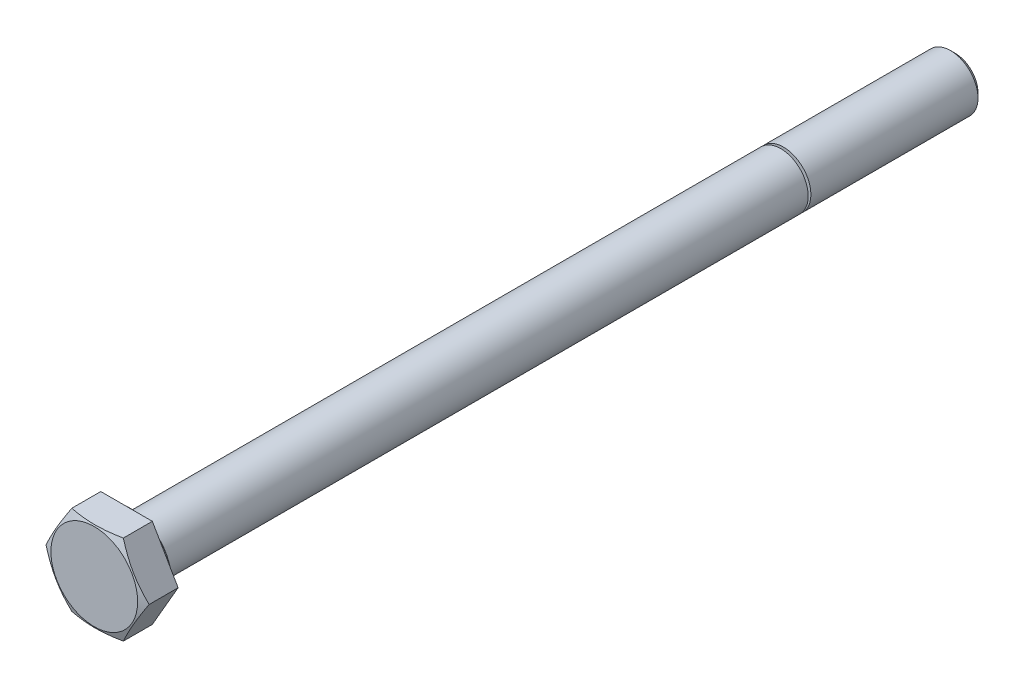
ISO-10303-21;
HEADER;
FILE_DESCRIPTION(('STEP AP214'),'2;1');
FILE_NAME('part.step','',(''),(''),'','','');
FILE_SCHEMA(('AUTOMOTIVE_DESIGN { 1 0 10303 214 1 1 1 1 }'));
ENDSEC;
DATA;
#1=APPLICATION_CONTEXT('core data for automotive mechanical design processes');
#2=APPLICATION_PROTOCOL_DEFINITION('international standard','automotive_design',2000,#1);
#3=PRODUCT_CONTEXT('',#1,'mechanical');
#4=PRODUCT('Part','Part','',(#3));
#5=PRODUCT_RELATED_PRODUCT_CATEGORY('part','',(#4));
#6=PRODUCT_DEFINITION_FORMATION('','',#4);
#7=PRODUCT_DEFINITION_CONTEXT('part definition',#1,'design');
#8=PRODUCT_DEFINITION('design','',#6,#7);
#9=PRODUCT_DEFINITION_SHAPE('','',#8);
#10=(LENGTH_UNIT() NAMED_UNIT(*) SI_UNIT(.MILLI.,.METRE.));
#11=(NAMED_UNIT(*) PLANE_ANGLE_UNIT() SI_UNIT($,.RADIAN.));
#12=(NAMED_UNIT(*) SI_UNIT($,.STERADIAN.) SOLID_ANGLE_UNIT());
#13=UNCERTAINTY_MEASURE_WITH_UNIT(LENGTH_MEASURE(1.E-05),#10,'distance_accuracy_value','');
#14=(GEOMETRIC_REPRESENTATION_CONTEXT(3) GLOBAL_UNCERTAINTY_ASSIGNED_CONTEXT((#13)) GLOBAL_UNIT_ASSIGNED_CONTEXT((#10,
#11,#12)) REPRESENTATION_CONTEXT('',''));
#15=CARTESIAN_POINT('',(0.,0.,0.));
#16=DIRECTION('',(0.,0.,1.));
#17=DIRECTION('',(1.,0.,0.));
#18=AXIS2_PLACEMENT_3D('',#15,#16,#17);
#19=CARTESIAN_POINT('',(0.,6.29999999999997,0.6));
#20=DIRECTION('',(0.,0.,1.));
#21=DIRECTION('',(1.,0.,0.));
#22=AXIS2_PLACEMENT_3D('',#19,#20,#21);
#23=PLANE('',#22);
#24=CARTESIAN_POINT('',(0.,0.,0.6));
#25=DIRECTION('',(0.,0.,1.));
#26=DIRECTION('',(1.,0.,0.));
#27=AXIS2_PLACEMENT_3D('',#24,#25,#26);
#28=CIRCLE('',#27,6.3);
#29=CARTESIAN_POINT('',(6.3,0.,0.599999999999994));
#30=VERTEX_POINT('',#29);
#31=EDGE_CURVE('E229',#30,#30,#28,.T.);
#32=ORIENTED_EDGE('',*,*,#31,.T.);
#33=EDGE_LOOP('',(#32));
#34=FACE_BOUND('',#33,.T.);
#35=DIRECTION('',(-1.,0.,0.));
#36=VECTOR('',#35,1.);
#37=CARTESIAN_POINT('',(0.,-6.4999969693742,0.6));
#38=LINE('',#37,#36);
#39=CARTESIAN_POINT('',(3.75277500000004,-6.49999696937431,0.6));
#40=VERTEX_POINT('',#39);
#41=CARTESIAN_POINT('',(-3.75277499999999,-6.49999696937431,0.6));
#42=VERTEX_POINT('',#41);
#43=EDGE_CURVE('E215',#40,#42,#38,.T.);
#44=ORIENTED_EDGE('',*,*,#43,.T.);
#45=DIRECTION('',(-0.500000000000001,0.866025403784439,0.));
#46=VECTOR('',#45,1.);
#47=CARTESIAN_POINT('',(-8.35714252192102,1.47500151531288,0.600000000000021));
#48=LINE('',#47,#46);
#49=CARTESIAN_POINT('',(-7.50555000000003,0.,0.600000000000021));
#50=VERTEX_POINT('',#49);
#51=EDGE_CURVE('E84',#42,#50,#48,.T.);
#52=ORIENTED_EDGE('',*,*,#51,.T.);
#53=DIRECTION('',(0.5,0.866025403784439,0.));
#54=VECTOR('',#53,1.);
#55=CARTESIAN_POINT('',(-2.901182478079,7.97499848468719,0.599999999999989));
#56=LINE('',#55,#54);
#57=CARTESIAN_POINT('',(-3.75277499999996,6.49999696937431,0.599999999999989));
#58=VERTEX_POINT('',#57);
#59=EDGE_CURVE('E223',#50,#58,#56,.T.);
#60=ORIENTED_EDGE('',*,*,#59,.T.);
#61=DIRECTION('',(1.,0.,0.));
#62=VECTOR('',#61,1.);
#63=CARTESIAN_POINT('',(0.,6.49999696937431,0.6));
#64=LINE('',#63,#62);
#65=CARTESIAN_POINT('',(3.75277499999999,6.49999696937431,0.6));
#66=VERTEX_POINT('',#65);
#67=EDGE_CURVE('E220',#58,#66,#64,.T.);
#68=ORIENTED_EDGE('',*,*,#67,.T.);
#69=DIRECTION('',(0.500000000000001,-0.866025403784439,0.));
#70=VECTOR('',#69,1.);
#71=CARTESIAN_POINT('',(2.90118247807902,7.97499848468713,0.6));
#72=LINE('',#71,#70);
#73=CARTESIAN_POINT('',(7.50555000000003,0.,0.599999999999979));
#74=VERTEX_POINT('',#73);
#75=EDGE_CURVE('E218',#66,#74,#72,.T.);
#76=ORIENTED_EDGE('',*,*,#75,.T.);
#77=DIRECTION('',(-0.5,-0.866025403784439,0.));
#78=VECTOR('',#77,1.);
#79=CARTESIAN_POINT('',(8.3571425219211,1.47500151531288,0.599999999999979));
#80=LINE('',#79,#78);
#81=EDGE_CURVE('E203',#74,#40,#80,.T.);
#82=ORIENTED_EDGE('',*,*,#81,.T.);
#83=EDGE_LOOP('',(#44,#52,#60,#68,#76,#82));
#84=FACE_BOUND('',#83,.T.);
#85=ADVANCED_FACE('F17',(#34,#84),#23,.F.);
#86=CARTESIAN_POINT('',(1.11022302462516E-13,0.,-120.));
#87=DIRECTION('',(0.,0.,1.));
#88=DIRECTION('',(1.,0.,0.));
#89=AXIS2_PLACEMENT_3D('',#86,#87,#88);
#90=PLANE('',#89);
#91=CARTESIAN_POINT('',(1.11022302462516E-13,0.,-120.));
#92=DIRECTION('',(0.,0.,1.));
#93=DIRECTION('',(1.,0.,0.));
#94=AXIS2_PLACEMENT_3D('',#91,#92,#93);
#95=CIRCLE('',#94,3.3234375);
#96=CARTESIAN_POINT('',(3.32343750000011,0.,-120.));
#97=VERTEX_POINT('',#96);
#98=EDGE_CURVE('E77',#97,#97,#95,.T.);
#99=ORIENTED_EDGE('',*,*,#98,.F.);
#100=EDGE_LOOP('',(#99));
#101=FACE_BOUND('',#100,.T.);
#102=ADVANCED_FACE('F19',(#101),#90,.F.);
#103=CARTESIAN_POINT('',(1.11022302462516E-13,0.,-120.));
#104=DIRECTION('',(0.,0.,1.));
#105=DIRECTION('',(1.,0.,0.));
#106=AXIS2_PLACEMENT_3D('',#103,#104,#105);
#107=CONICAL_SURFACE('',#106,3.3234375,0.785398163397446);
#108=CARTESIAN_POINT('',(1.11022302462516E-13,0.,-119.3234375));
#109=DIRECTION('',(0.,0.,1.));
#110=DIRECTION('',(1.,0.,0.));
#111=AXIS2_PLACEMENT_3D('',#108,#109,#110);
#112=CIRCLE('',#111,4.);
#113=CARTESIAN_POINT('',(4.00000000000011,0.,-119.3234375));
#114=VERTEX_POINT('',#113);
#115=EDGE_CURVE('E173',#114,#114,#112,.T.);
#116=ORIENTED_EDGE('',*,*,#115,.F.);
#117=EDGE_LOOP('',(#116));
#118=FACE_BOUND('',#117,.T.);
#119=ORIENTED_EDGE('',*,*,#98,.T.);
#120=EDGE_LOOP('',(#119));
#121=FACE_BOUND('',#120,.T.);
#122=ADVANCED_FACE('F135',(#118,#121),#107,.T.);
#123=CARTESIAN_POINT('',(0.,0.,5.3));
#124=DIRECTION('',(0.,0.,1.));
#125=DIRECTION('',(1.,0.,0.));
#126=AXIS2_PLACEMENT_3D('',#123,#124,#125);
#127=CYLINDRICAL_SURFACE('',#126,4.);
#128=CARTESIAN_POINT('',(1.11022302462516E-13,0.,-95.));
#129=DIRECTION('',(0.,0.,1.));
#130=DIRECTION('',(1.,0.,0.));
#131=AXIS2_PLACEMENT_3D('',#128,#129,#130);
#132=CIRCLE('',#131,4.);
#133=CARTESIAN_POINT('',(4.00000000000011,0.,-95.));
#134=VERTEX_POINT('',#133);
#135=EDGE_CURVE('E177',#134,#134,#132,.T.);
#136=ORIENTED_EDGE('',*,*,#135,.F.);
#137=EDGE_LOOP('',(#136));
#138=FACE_BOUND('',#137,.T.);
#139=ORIENTED_EDGE('',*,*,#115,.T.);
#140=EDGE_LOOP('',(#139));
#141=FACE_BOUND('',#140,.T.);
#142=ADVANCED_FACE('F162',(#138,#141),#127,.T.);
#143=CARTESIAN_POINT('',(0.,4.,-95.));
#144=DIRECTION('',(0.,0.,-1.));
#145=DIRECTION('',(-1.,0.,0.));
#146=AXIS2_PLACEMENT_3D('',#143,#144,#145);
#147=PLANE('',#146);
#148=CARTESIAN_POINT('',(1.11022302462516E-13,0.,-95.));
#149=DIRECTION('',(0.,0.,1.));
#150=DIRECTION('',(1.,0.,0.));
#151=AXIS2_PLACEMENT_3D('',#148,#149,#150);
#152=CIRCLE('',#151,3.3234375);
#153=CARTESIAN_POINT('',(3.32343750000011,0.,-95.));
#154=VERTEX_POINT('',#153);
#155=EDGE_CURVE('E243',#154,#154,#152,.T.);
#156=ORIENTED_EDGE('',*,*,#155,.F.);
#157=EDGE_LOOP('',(#156));
#158=FACE_BOUND('',#157,.T.);
#159=ORIENTED_EDGE('',*,*,#135,.T.);
#160=EDGE_LOOP('',(#159));
#161=FACE_BOUND('',#160,.T.);
#162=ADVANCED_FACE('F158',(#158,#161),#147,.F.);
#163=CARTESIAN_POINT('',(1.11022302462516E-13,0.,-95.));
#164=DIRECTION('',(0.,0.,1.));
#165=DIRECTION('',(1.,0.,0.));
#166=AXIS2_PLACEMENT_3D('',#163,#164,#165);
#167=CONICAL_SURFACE('',#166,3.3234375,1.0471975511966);
#168=CARTESIAN_POINT('',(1.11022302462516E-13,0.,-94.6093864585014));
#169=DIRECTION('',(0.,0.,1.));
#170=DIRECTION('',(1.,0.,0.));
#171=AXIS2_PLACEMENT_3D('',#168,#169,#170);
#172=CIRCLE('',#171,4.);
#173=CARTESIAN_POINT('',(4.00000000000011,0.,-94.6093864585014));
#174=VERTEX_POINT('',#173);
#175=EDGE_CURVE('E240',#174,#174,#172,.T.);
#176=ORIENTED_EDGE('',*,*,#175,.F.);
#177=EDGE_LOOP('',(#176));
#178=FACE_BOUND('',#177,.T.);
#179=ORIENTED_EDGE('',*,*,#155,.T.);
#180=EDGE_LOOP('',(#179));
#181=FACE_BOUND('',#180,.T.);
#182=ADVANCED_FACE('F154',(#178,#181),#167,.T.);
#183=CARTESIAN_POINT('',(0.,0.,5.3));
#184=DIRECTION('',(0.,0.,1.));
#185=DIRECTION('',(1.,0.,0.));
#186=AXIS2_PLACEMENT_3D('',#183,#184,#185);
#187=CYLINDRICAL_SURFACE('',#186,4.);
#188=CARTESIAN_POINT('',(0.,0.,-0.400000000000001));
#189=DIRECTION('',(0.,0.,1.));
#190=DIRECTION('',(1.,0.,0.));
#191=AXIS2_PLACEMENT_3D('',#188,#189,#190);
#192=CIRCLE('',#191,4.);
#193=CARTESIAN_POINT('',(4.,0.,-0.400000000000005));
#194=VERTEX_POINT('',#193);
#195=EDGE_CURVE('E237',#194,#194,#192,.T.);
#196=ORIENTED_EDGE('',*,*,#195,.F.);
#197=EDGE_LOOP('',(#196));
#198=FACE_BOUND('',#197,.T.);
#199=ORIENTED_EDGE('',*,*,#175,.T.);
#200=EDGE_LOOP('',(#199));
#201=FACE_BOUND('',#200,.T.);
#202=ADVANCED_FACE('F150',(#198,#201),#187,.T.);
#203=CARTESIAN_POINT('',(0.,0.,-0.400000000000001));
#204=DIRECTION('',(0.,0.,1.));
#205=DIRECTION('',(1.,0.,0.));
#206=AXIS2_PLACEMENT_3D('',#203,#204,#205);
#207=TOROIDAL_SURFACE('',#206,4.4,0.4);
#208=ORIENTED_EDGE('',*,*,#195,.T.);
#209=EDGE_LOOP('',(#208));
#210=FACE_BOUND('',#209,.T.);
#211=CARTESIAN_POINT('',(0.,0.,0.));
#212=DIRECTION('',(0.,0.,1.));
#213=DIRECTION('',(1.,0.,0.));
#214=AXIS2_PLACEMENT_3D('',#211,#212,#213);
#215=CIRCLE('',#214,4.4);
#216=CARTESIAN_POINT('',(4.4,0.,0.));
#217=VERTEX_POINT('',#216);
#218=EDGE_CURVE('E234',#217,#217,#215,.T.);
#219=ORIENTED_EDGE('',*,*,#218,.F.);
#220=EDGE_LOOP('',(#219));
#221=FACE_BOUND('',#220,.T.);
#222=ADVANCED_FACE('F146',(#210,#221),#207,.F.);
#223=CARTESIAN_POINT('',(0.,4.40000000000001,0.));
#224=DIRECTION('',(0.,0.,1.));
#225=DIRECTION('',(1.,0.,0.));
#226=AXIS2_PLACEMENT_3D('',#223,#224,#225);
#227=PLANE('',#226);
#228=CARTESIAN_POINT('',(0.,0.,0.));
#229=DIRECTION('',(0.,0.,1.));
#230=DIRECTION('',(1.,0.,0.));
#231=AXIS2_PLACEMENT_3D('',#228,#229,#230);
#232=CIRCLE('',#231,5.7);
#233=CARTESIAN_POINT('',(5.7,0.,0.));
#234=VERTEX_POINT('',#233);
#235=EDGE_CURVE('E231',#234,#234,#232,.T.);
#236=ORIENTED_EDGE('',*,*,#235,.F.);
#237=EDGE_LOOP('',(#236));
#238=FACE_BOUND('',#237,.T.);
#239=ORIENTED_EDGE('',*,*,#218,.T.);
#240=EDGE_LOOP('',(#239));
#241=FACE_BOUND('',#240,.T.);
#242=ADVANCED_FACE('F142',(#238,#241),#227,.F.);
#243=CARTESIAN_POINT('',(0.,0.,0.6));
#244=DIRECTION('',(0.,0.,1.));
#245=DIRECTION('',(1.,0.,0.));
#246=AXIS2_PLACEMENT_3D('',#243,#244,#245);
#247=TOROIDAL_SURFACE('',#246,5.7,0.6);
#248=ORIENTED_EDGE('',*,*,#31,.F.);
#249=EDGE_LOOP('',(#248));
#250=FACE_BOUND('',#249,.T.);
#251=ORIENTED_EDGE('',*,*,#235,.T.);
#252=EDGE_LOOP('',(#251));
#253=FACE_BOUND('',#252,.T.);
#254=ADVANCED_FACE('F117',(#250,#253),#247,.T.);
#255=CARTESIAN_POINT('',(-3.75277499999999,-6.49999696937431,-120.));
#256=DIRECTION('',(0.866025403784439,0.5,0.));
#257=DIRECTION('',(0.500000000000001,-0.866025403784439,0.));
#258=AXIS2_PLACEMENT_3D('',#255,#256,#257);
#259=PLANE('',#258);
#260=ORIENTED_EDGE('',*,*,#51,.F.);
#261=DIRECTION('',(0.,0.,1.));
#262=VECTOR('',#261,1.);
#263=CARTESIAN_POINT('',(-3.75277499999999,-6.49999696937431,-120.));
#264=LINE('',#263,#262);
#265=CARTESIAN_POINT('',(-3.75277499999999,-6.49999696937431,4.81818181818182));
#266=VERTEX_POINT('',#265);
#267=EDGE_CURVE('E37',#42,#266,#264,.T.);
#268=ORIENTED_EDGE('',*,*,#267,.T.);
#269=CARTESIAN_POINT('',(-7.50555011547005,2.00000016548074E-07,4.81818177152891));
#270=CARTESIAN_POINT('',(-7.37443828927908,-0.227092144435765,4.87115743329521));
#271=CARTESIAN_POINT('',(-7.24289371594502,-0.454934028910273,4.92014195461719));
#272=CARTESIAN_POINT('',(-6.97893474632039,-0.912124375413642,5.00862317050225));
#273=CARTESIAN_POINT('',(-6.84651988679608,-1.14147363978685,5.04811430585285));
#274=CARTESIAN_POINT('',(-6.58100882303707,-1.60135229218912,5.11602763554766));
#275=CARTESIAN_POINT('',(-6.44791283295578,-1.8318813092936,5.14445311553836));
#276=CARTESIAN_POINT('',(-6.18122645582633,-2.29379566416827,5.18891785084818));
#277=CARTESIAN_POINT('',(-6.04763618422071,-2.52518080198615,5.20495983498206));
#278=CARTESIAN_POINT('',(-5.78248936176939,-2.98442856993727,5.22365999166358));
#279=CARTESIAN_POINT('',(-5.65093679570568,-3.21228429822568,5.22654079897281));
#280=CARTESIAN_POINT('',(-5.387909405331,-3.66786110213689,5.21936907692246));
#281=CARTESIAN_POINT('',(-5.25643458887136,-3.89558216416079,5.20931541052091));
#282=CARTESIAN_POINT('',(-4.99395979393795,-4.35020184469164,5.17681520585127));
#283=CARTESIAN_POINT('',(-4.86295956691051,-4.57710089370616,5.15437654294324));
#284=CARTESIAN_POINT('',(-4.60158457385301,-5.02981566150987,5.09819377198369));
#285=CARTESIAN_POINT('',(-4.47120974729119,-5.25563148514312,5.06445078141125));
#286=CARTESIAN_POINT('',(-4.29203841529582,-5.56596533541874,5.01111287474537));
#287=CARTESIAN_POINT('',(-4.24291545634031,-5.65104879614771,4.99576396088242));
#288=CARTESIAN_POINT('',(-4.14478547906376,-5.82101490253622,4.9637295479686));
#289=CARTESIAN_POINT('',(-4.0957784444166,-5.9058975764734,4.94704425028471));
#290=CARTESIAN_POINT('',(-3.99770849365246,-6.07575971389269,4.91235486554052));
#291=CARTESIAN_POINT('',(-3.94864596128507,-6.16073851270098,4.89434645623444));
#292=CARTESIAN_POINT('',(-3.85062839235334,-6.33050992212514,4.85713794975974));
#293=CARTESIAN_POINT('',(-3.80167336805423,-6.41530251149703,4.83793772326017));
#294=CARTESIAN_POINT('',(-3.75277488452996,-6.49999716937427,4.81818177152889));
#295=B_SPLINE_CURVE_WITH_KNOTS('',3,(#269,#270,#271,#272,#273,#274,#275,#276,#277,#278,#279,
#280,#281,#282,#283,#284,#285,#286,#287,#288,#289,#290,#291,#292,#293,#294),.UNSPECIFIED.,.F.,
.F.,(4,2,2,2,2,2,2,2,2,2,2,2,4),(0.,0.802620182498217,1.60570923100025,2.40855964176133,
3.21123308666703,4.00027695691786,4.7893901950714,5.57800222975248,6.36653632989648,
6.66484369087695,6.96310618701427,7.26239050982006,7.56170736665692),.UNSPECIFIED.);
#296=CARTESIAN_POINT('',(-7.50554999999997,0.,4.81818181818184));
#297=VERTEX_POINT('',#296);
#298=EDGE_CURVE('E11',#297,#266,#295,.T.);
#299=ORIENTED_EDGE('',*,*,#298,.F.);
#300=DIRECTION('',(0.,0.,1.));
#301=VECTOR('',#300,1.);
#302=CARTESIAN_POINT('',(-7.50555,0.,-120.));
#303=LINE('',#302,#301);
#304=EDGE_CURVE('E213',#50,#297,#303,.T.);
#305=ORIENTED_EDGE('',*,*,#304,.F.);
#306=EDGE_LOOP('',(#260,#268,#299,#305));
#307=FACE_BOUND('',#306,.T.);
#308=ADVANCED_FACE('F80',(#307),#259,.F.);
#309=CARTESIAN_POINT('',(-7.50555,0.,-120.));
#310=DIRECTION('',(0.866025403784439,-0.5,0.));
#311=DIRECTION('',(-0.5,-0.866025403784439,0.));
#312=AXIS2_PLACEMENT_3D('',#309,#310,#311);
#313=PLANE('',#312);
#314=ORIENTED_EDGE('',*,*,#59,.F.);
#315=ORIENTED_EDGE('',*,*,#304,.T.);
#316=CARTESIAN_POINT('',(-3.75277488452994,6.49999716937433,4.81818177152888));
#317=CARTESIAN_POINT('',(-3.8838867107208,6.27290482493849,4.87115743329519));
#318=CARTESIAN_POINT('',(-4.01543128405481,6.04506294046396,4.92014195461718));
#319=CARTESIAN_POINT('',(-4.27939025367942,5.58787259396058,5.00862317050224));
#320=CARTESIAN_POINT('',(-4.41180511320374,5.35852332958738,5.04811430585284));
#321=CARTESIAN_POINT('',(-4.67731617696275,4.89864467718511,5.11602763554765));
#322=CARTESIAN_POINT('',(-4.81041216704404,4.66811566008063,5.14445311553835));
#323=CARTESIAN_POINT('',(-5.07709854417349,4.20620130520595,5.18891785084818));
#324=CARTESIAN_POINT('',(-5.21068881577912,3.97481616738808,5.20495983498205));
#325=CARTESIAN_POINT('',(-5.47583563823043,3.51556839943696,5.22365999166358));
#326=CARTESIAN_POINT('',(-5.60738820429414,3.28771267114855,5.2265407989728));
#327=CARTESIAN_POINT('',(-5.87041559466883,2.83213586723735,5.21936907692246));
#328=CARTESIAN_POINT('',(-6.00189041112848,2.60441480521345,5.20931541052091));
#329=CARTESIAN_POINT('',(-6.26436520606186,2.14979512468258,5.17681520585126));
#330=CARTESIAN_POINT('',(-6.39536543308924,1.92289607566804,5.15437654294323));
#331=CARTESIAN_POINT('',(-6.65674042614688,1.4701813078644,5.0981937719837));
#332=CARTESIAN_POINT('',(-6.78711525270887,1.24436548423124,5.06445078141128));
#333=CARTESIAN_POINT('',(-6.96628658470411,0.934031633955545,5.01111287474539));
#334=CARTESIAN_POINT('',(-7.01540954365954,0.848948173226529,4.99576396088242));
#335=CARTESIAN_POINT('',(-7.11353952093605,0.67898206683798,4.96372954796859));
#336=CARTESIAN_POINT('',(-7.16254655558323,0.594099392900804,4.94704425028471));
#337=CARTESIAN_POINT('',(-7.26061650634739,0.424237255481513,4.91235486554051));
#338=CARTESIAN_POINT('',(-7.30967903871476,0.33925845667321,4.89434645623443));
#339=CARTESIAN_POINT('',(-7.40769660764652,0.169487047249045,4.85713794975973));
#340=CARTESIAN_POINT('',(-7.45665163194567,0.084694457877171,4.83793772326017));
#341=CARTESIAN_POINT('',(-7.50555011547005,-2.00000016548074E-07,4.81818177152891));
#342=B_SPLINE_CURVE_WITH_KNOTS('',3,(#316,#317,#318,#319,#320,#321,#322,#323,#324,#325,#326,
#327,#328,#329,#330,#331,#332,#333,#334,#335,#336,#337,#338,#339,#340,#341),.UNSPECIFIED.,.F.,
.F.,(4,2,2,2,2,2,2,2,2,2,2,2,4),(0.,0.802620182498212,1.60570923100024,2.40855964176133,
3.21123308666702,4.00027695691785,4.78939019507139,5.57800222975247,6.36653632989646,
6.66484369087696,6.96310618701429,7.26239050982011,7.56170736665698),.UNSPECIFIED.);
#343=CARTESIAN_POINT('',(-3.75277499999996,6.49999696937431,4.81818181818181));
#344=VERTEX_POINT('',#343);
#345=EDGE_CURVE('E30',#344,#297,#342,.T.);
#346=ORIENTED_EDGE('',*,*,#345,.F.);
#347=DIRECTION('',(0.,0.,1.));
#348=VECTOR('',#347,1.);
#349=CARTESIAN_POINT('',(-3.75277499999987,6.49999696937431,-120.));
#350=LINE('',#349,#348);
#351=EDGE_CURVE('E208',#58,#344,#350,.T.);
#352=ORIENTED_EDGE('',*,*,#351,.F.);
#353=EDGE_LOOP('',(#314,#315,#346,#352));
#354=FACE_BOUND('',#353,.T.);
#355=ADVANCED_FACE('F109',(#354),#313,.F.);
#356=CARTESIAN_POINT('',(-3.75277499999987,6.49999696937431,-120.));
#357=DIRECTION('',(0.,-1.,0.));
#358=DIRECTION('',(-1.,0.,0.));
#359=AXIS2_PLACEMENT_3D('',#356,#357,#358);
#360=PLANE('',#359);
#361=ORIENTED_EDGE('',*,*,#67,.F.);
#362=ORIENTED_EDGE('',*,*,#351,.T.);
#363=CARTESIAN_POINT('',(-10.2189559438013,6.49999696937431,2.95744755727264));
#364=CARTESIAN_POINT('',(-9.91517393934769,6.49999696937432,3.06097856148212));
#365=CARTESIAN_POINT('',(-9.61099699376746,6.49999696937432,3.16337208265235));
#366=CARTESIAN_POINT('',(-9.0016401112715,6.49999696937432,3.36522758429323));
#367=CARTESIAN_POINT('',(-8.69646007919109,6.49999696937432,3.46468927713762));
#368=CARTESIAN_POINT('',(-8.0841079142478,6.49999696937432,3.66027084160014));
#369=CARTESIAN_POINT('',(-7.77693261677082,6.49999696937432,3.7563808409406));
#370=CARTESIAN_POINT('',(-7.16119626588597,6.49999696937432,3.94404451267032));
#371=CARTESIAN_POINT('',(-6.85263524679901,6.49999696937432,4.03559829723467));
#372=CARTESIAN_POINT('',(-6.23544979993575,6.49999696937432,4.21250589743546));
#373=CARTESIAN_POINT('',(-5.92683386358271,6.49999696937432,4.29788918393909));
#374=CARTESIAN_POINT('',(-5.30767413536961,6.49999696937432,4.46145753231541));
#375=CARTESIAN_POINT('',(-4.9971302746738,6.49999696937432,4.53964233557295));
#376=CARTESIAN_POINT('',(-4.37409806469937,6.49999696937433,4.68683785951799));
#377=CARTESIAN_POINT('',(-4.06161131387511,6.49999696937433,4.75585528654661));
#378=CARTESIAN_POINT('',(-3.43432011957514,6.49999696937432,4.88245049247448));
#379=CARTESIAN_POINT('',(-3.11951588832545,6.49999696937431,4.94002930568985));
#380=CARTESIAN_POINT('',(-2.56247883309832,6.49999696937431,5.02916140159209));
#381=CARTESIAN_POINT('',(-2.32071751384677,6.49999696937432,5.06364877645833));
#382=CARTESIAN_POINT('',(-1.83603686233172,6.49999696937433,5.12328692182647));
#383=CARTESIAN_POINT('',(-1.59311756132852,6.49999696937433,5.14843794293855));
#384=CARTESIAN_POINT('',(-1.10655056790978,6.49999696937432,5.18840574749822));
#385=CARTESIAN_POINT('',(-0.862903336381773,6.49999696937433,5.20322806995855));
#386=CARTESIAN_POINT('',(-0.375184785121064,6.49999696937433,5.22190904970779));
#387=CARTESIAN_POINT('',(-0.13111346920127,6.49999696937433,5.22576780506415));
#388=CARTESIAN_POINT('',(0.35703072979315,6.49999696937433,5.22234236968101));
#389=CARTESIAN_POINT('',(0.601103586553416,6.49999696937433,5.21505448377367));
#390=CARTESIAN_POINT('',(1.08868087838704,6.49999696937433,5.18966361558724));
#391=CARTESIAN_POINT('',(1.33218530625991,6.49999696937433,5.17156049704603));
#392=CARTESIAN_POINT('',(1.81835999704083,6.49999696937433,5.12529953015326));
#393=CARTESIAN_POINT('',(2.06102972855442,6.49999696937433,5.09713616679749));
#394=CARTESIAN_POINT('',(2.54516109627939,6.49999696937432,5.03181140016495));
#395=CARTESIAN_POINT('',(2.78662262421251,6.49999696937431,4.99464920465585));
#396=CARTESIAN_POINT('',(3.34298104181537,6.49999696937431,4.89974655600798));
#397=CARTESIAN_POINT('',(3.65739707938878,6.49999696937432,4.83919947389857));
#398=CARTESIAN_POINT('',(4.28393227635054,6.49999696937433,4.70724199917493));
#399=CARTESIAN_POINT('',(4.59605124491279,6.49999696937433,4.63583071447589));
#400=CARTESIAN_POINT('',(5.21835286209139,6.49999696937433,4.48434129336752));
#401=CARTESIAN_POINT('',(5.52853428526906,6.49999696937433,4.40425816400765));
#402=CARTESIAN_POINT('',(6.14703474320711,6.49999696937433,4.23728271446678));
#403=CARTESIAN_POINT('',(6.45535384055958,6.49999696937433,4.15039062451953));
#404=CARTESIAN_POINT('',(7.07126517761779,6.49999696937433,3.9709781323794));
#405=CARTESIAN_POINT('',(7.3788530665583,6.49999696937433,3.87844286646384));
#406=CARTESIAN_POINT('',(7.99270470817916,6.49999696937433,3.68907124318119));
#407=CARTESIAN_POINT('',(8.29896843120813,6.49999696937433,3.59223479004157));
#408=CARTESIAN_POINT('',(8.90966004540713,6.49999696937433,3.3953616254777));
#409=CARTESIAN_POINT('',(9.21409056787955,6.49999696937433,3.29533304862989));
#410=CARTESIAN_POINT('',(9.82199417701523,6.49999696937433,3.09249187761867));
#411=CARTESIAN_POINT('',(10.1254673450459,6.49999696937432,2.98967952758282));
#412=CARTESIAN_POINT('',(10.4285624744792,6.49999696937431,2.88578331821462));
#413=B_SPLINE_CURVE_WITH_KNOTS('',3,(#363,#364,#365,#366,#367,#368,#369,#370,#371,#372,#373,
#374,#375,#376,#377,#378,#379,#380,#381,#382,#383,#384,#385,#386,#387,#388,#389,#390,#391,#392,
#393,#394,#395,#396,#397,#398,#399,#400,#401,#402,#403,#404,#405,#406,#407,#408,#409,#410,#411,
#412),.UNSPECIFIED.,.F.,.F.,(4,2,2,2,2,2,2,2,2,2,2,2,2,2,2,2,2,2,2,2,2,2,2,2,4),(0.,
0.962826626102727,1.92574739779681,2.89129888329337,3.85682658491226,4.81738746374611,
5.77798283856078,6.73787157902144,7.69767348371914,8.43014406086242,9.16259497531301,
9.89465279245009,10.6267040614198,11.3589980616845,12.0913012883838,12.824006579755,
13.5567763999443,14.5171015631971,15.4775056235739,16.4384656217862,17.3993931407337,
18.3629712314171,19.3265707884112,20.2878850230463,21.2491152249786),.UNSPECIFIED.);
#414=CARTESIAN_POINT('',(3.75277499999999,6.49999696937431,4.81818181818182));
#415=VERTEX_POINT('',#414);
#416=EDGE_CURVE('E91',#415,#344,#413,.F.);
#417=ORIENTED_EDGE('',*,*,#416,.F.);
#418=DIRECTION('',(0.,0.,1.));
#419=VECTOR('',#418,1.);
#420=CARTESIAN_POINT('',(3.75277500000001,6.49999696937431,-120.));
#421=LINE('',#420,#419);
#422=EDGE_CURVE('E205',#66,#415,#421,.T.);
#423=ORIENTED_EDGE('',*,*,#422,.F.);
#424=EDGE_LOOP('',(#361,#362,#417,#423));
#425=FACE_BOUND('',#424,.T.);
#426=ADVANCED_FACE('F112',(#425),#360,.F.);
#427=CARTESIAN_POINT('',(3.75277500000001,6.49999696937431,-120.));
#428=DIRECTION('',(-0.866025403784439,-0.5,0.));
#429=DIRECTION('',(-0.500000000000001,0.866025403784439,0.));
#430=AXIS2_PLACEMENT_3D('',#427,#428,#429);
#431=PLANE('',#430);
#432=ORIENTED_EDGE('',*,*,#75,.F.);
#433=ORIENTED_EDGE('',*,*,#422,.T.);
#434=CARTESIAN_POINT('',(7.50555011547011,-2.00000016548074E-07,4.81818177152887));
#435=CARTESIAN_POINT('',(7.37443828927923,0.227092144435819,4.87115743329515));
#436=CARTESIAN_POINT('',(7.24289371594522,0.454934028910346,4.92014195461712));
#437=CARTESIAN_POINT('',(6.97893474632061,0.912124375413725,5.00862317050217));
#438=CARTESIAN_POINT('',(6.84651988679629,1.14147363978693,5.04811430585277));
#439=CARTESIAN_POINT('',(6.58100882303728,1.60135229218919,5.11602763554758));
#440=CARTESIAN_POINT('',(6.44791283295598,1.83188130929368,5.14445311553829));
#441=CARTESIAN_POINT('',(6.18122645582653,2.29379566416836,5.18891785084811));
#442=CARTESIAN_POINT('',(6.0476361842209,2.52518080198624,5.20495983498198));
#443=CARTESIAN_POINT('',(5.78248936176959,2.98442856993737,5.22365999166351));
#444=CARTESIAN_POINT('',(5.65093679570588,3.21228429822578,5.22654079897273));
#445=CARTESIAN_POINT('',(5.38790940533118,3.66786110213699,5.21936907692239));
#446=CARTESIAN_POINT('',(5.25643458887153,3.89558216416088,5.20931541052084));
#447=CARTESIAN_POINT('',(4.99395979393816,4.35020184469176,5.17681520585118));
#448=CARTESIAN_POINT('',(4.86295956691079,4.57710089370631,5.15437654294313));
#449=CARTESIAN_POINT('',(4.60158457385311,5.02981566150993,5.09819377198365));
#450=CARTESIAN_POINT('',(4.47120974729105,5.25563148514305,5.06445078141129));
#451=CARTESIAN_POINT('',(4.29203841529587,5.56596533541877,5.01111287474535));
#452=CARTESIAN_POINT('',(4.24291545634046,5.6510487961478,4.99576396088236));
#453=CARTESIAN_POINT('',(4.14478547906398,5.82101490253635,4.96372954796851));
#454=CARTESIAN_POINT('',(4.0957784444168,5.90589757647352,4.94704425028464));
#455=CARTESIAN_POINT('',(3.99770849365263,6.07575971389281,4.91235486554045));
#456=CARTESIAN_POINT('',(3.94864596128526,6.16073851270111,4.89434645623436));
#457=CARTESIAN_POINT('',(3.85062839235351,6.33050992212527,4.85713794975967));
#458=CARTESIAN_POINT('',(3.80167336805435,6.41530251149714,4.83793772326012));
#459=CARTESIAN_POINT('',(3.75277488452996,6.49999716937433,4.81818177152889));
#460=B_SPLINE_CURVE_WITH_KNOTS('',3,(#434,#435,#436,#437,#438,#439,#440,#441,#442,#443,#444,
#445,#446,#447,#448,#449,#450,#451,#452,#453,#454,#455,#456,#457,#458,#459),.UNSPECIFIED.,.F.,
.F.,(4,2,2,2,2,2,2,2,2,2,2,2,4),(0.,0.802620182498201,1.60570923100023,2.40855964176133,
3.21123308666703,4.00027695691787,4.78939019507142,5.5780022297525,6.36653632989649,
6.66484369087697,6.9631061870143,7.26239050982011,7.56170736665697),.UNSPECIFIED.);
#461=CARTESIAN_POINT('',(7.50555000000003,0.,4.8181818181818));
#462=VERTEX_POINT('',#461);
#463=EDGE_CURVE('E95',#462,#415,#460,.T.);
#464=ORIENTED_EDGE('',*,*,#463,.F.);
#465=DIRECTION('',(0.,0.,1.));
#466=VECTOR('',#465,1.);
#467=CARTESIAN_POINT('',(7.50555000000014,0.,-120.));
#468=LINE('',#467,#466);
#469=EDGE_CURVE('E202',#74,#462,#468,.T.);
#470=ORIENTED_EDGE('',*,*,#469,.F.);
#471=EDGE_LOOP('',(#432,#433,#464,#470));
#472=FACE_BOUND('',#471,.T.);
#473=ADVANCED_FACE('F191',(#472),#431,.F.);
#474=CARTESIAN_POINT('',(7.50555000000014,0.,-120.));
#475=DIRECTION('',(-0.866025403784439,0.5,0.));
#476=DIRECTION('',(0.5,0.866025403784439,0.));
#477=AXIS2_PLACEMENT_3D('',#474,#475,#476);
#478=PLANE('',#477);
#479=ORIENTED_EDGE('',*,*,#81,.F.);
#480=ORIENTED_EDGE('',*,*,#469,.T.);
#481=CARTESIAN_POINT('',(3.75277488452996,-6.49999716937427,4.81818177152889));
#482=CARTESIAN_POINT('',(3.88388671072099,-6.27290482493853,4.87115743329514));
#483=CARTESIAN_POINT('',(4.01543128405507,-6.04506294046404,4.9201419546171));
#484=CARTESIAN_POINT('',(4.27939025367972,-5.58787259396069,5.00862317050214));
#485=CARTESIAN_POINT('',(4.41180511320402,-5.35852332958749,5.04811430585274));
#486=CARTESIAN_POINT('',(4.67731617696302,-4.89864467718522,5.11602763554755));
#487=CARTESIAN_POINT('',(4.81041216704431,-4.66811566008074,5.14445311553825));
#488=CARTESIAN_POINT('',(5.07709854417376,-4.20620130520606,5.18891785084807));
#489=CARTESIAN_POINT('',(5.21068881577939,-3.97481616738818,5.20495983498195));
#490=CARTESIAN_POINT('',(5.47583563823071,-3.51556839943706,5.22365999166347));
#491=CARTESIAN_POINT('',(5.60738820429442,-3.28771267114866,5.22654079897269));
#492=CARTESIAN_POINT('',(5.87041559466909,-2.83213586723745,5.21936907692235));
#493=CARTESIAN_POINT('',(6.00189041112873,-2.60441480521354,5.20931541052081));
#494=CARTESIAN_POINT('',(6.26436520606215,-2.14979512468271,5.17681520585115));
#495=CARTESIAN_POINT('',(6.39536543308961,-1.92289607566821,5.1543765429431));
#496=CARTESIAN_POINT('',(6.65674042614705,-1.47018130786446,5.09819377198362));
#497=CARTESIAN_POINT('',(6.78711525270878,-1.24436548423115,5.06445078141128));
#498=CARTESIAN_POINT('',(6.96628658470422,-0.93403163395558,5.01111287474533));
#499=CARTESIAN_POINT('',(7.01540954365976,-0.848948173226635,4.99576396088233));
#500=CARTESIAN_POINT('',(7.11353952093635,-0.678982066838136,4.96372954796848));
#501=CARTESIAN_POINT('',(7.16254655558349,-0.59409939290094,4.94704425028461));
#502=CARTESIAN_POINT('',(7.26061650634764,-0.424237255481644,4.91235486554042));
#503=CARTESIAN_POINT('',(7.30967903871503,-0.339258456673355,4.89434645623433));
#504=CARTESIAN_POINT('',(7.40769660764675,-0.169487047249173,4.85713794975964));
#505=CARTESIAN_POINT('',(7.45665163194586,-0.084694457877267,4.8379377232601));
#506=CARTESIAN_POINT('',(7.50555011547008,2.00000016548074E-07,4.81818177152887));
#507=B_SPLINE_CURVE_WITH_KNOTS('',3,(#481,#482,#483,#484,#485,#486,#487,#488,#489,#490,#491,
#492,#493,#494,#495,#496,#497,#498,#499,#500,#501,#502,#503,#504,#505,#506),.UNSPECIFIED.,.F.,
.F.,(4,2,2,2,2,2,2,2,2,2,2,2,4),(0.,0.802620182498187,1.6057092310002,2.40855964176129,
3.21123308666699,4.00027695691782,4.78939019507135,5.57800222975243,6.3665363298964,
6.66484369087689,6.96310618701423,7.26239050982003,7.5617073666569),.UNSPECIFIED.);
#508=CARTESIAN_POINT('',(3.75277500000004,-6.49999696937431,4.81818181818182));
#509=VERTEX_POINT('',#508);
#510=EDGE_CURVE('E76',#509,#462,#507,.T.);
#511=ORIENTED_EDGE('',*,*,#510,.F.);
#512=DIRECTION('',(0.,0.,1.));
#513=VECTOR('',#512,1.);
#514=CARTESIAN_POINT('',(3.75277500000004,-6.49999696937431,-120.));
#515=LINE('',#514,#513);
#516=EDGE_CURVE('E42',#40,#509,#515,.T.);
#517=ORIENTED_EDGE('',*,*,#516,.F.);
#518=EDGE_LOOP('',(#479,#480,#511,#517));
#519=FACE_BOUND('',#518,.T.);
#520=ADVANCED_FACE('F127',(#519),#478,.F.);
#521=CARTESIAN_POINT('',(3.75277500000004,-6.49999696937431,-120.));
#522=DIRECTION('',(0.,1.,0.));
#523=DIRECTION('',(1.,0.,0.));
#524=AXIS2_PLACEMENT_3D('',#521,#522,#523);
#525=PLANE('',#524);
#526=ORIENTED_EDGE('',*,*,#43,.F.);
#527=ORIENTED_EDGE('',*,*,#516,.T.);
#528=CARTESIAN_POINT('',(-10.2189559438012,-6.49999696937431,2.95744755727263));
#529=CARTESIAN_POINT('',(-9.91517393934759,-6.49999696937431,3.06097856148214));
#530=CARTESIAN_POINT('',(-9.61099699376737,-6.49999696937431,3.16337208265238));
#531=CARTESIAN_POINT('',(-9.00164011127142,-6.49999696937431,3.36522758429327));
#532=CARTESIAN_POINT('',(-8.69646007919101,-6.49999696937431,3.46468927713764));
#533=CARTESIAN_POINT('',(-8.08410791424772,-6.49999696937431,3.66027084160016));
#534=CARTESIAN_POINT('',(-7.77693261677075,-6.49999696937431,3.75638084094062));
#535=CARTESIAN_POINT('',(-7.16119626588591,-6.49999696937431,3.94404451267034));
#536=CARTESIAN_POINT('',(-6.85263524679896,-6.4999969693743,4.03559829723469));
#537=CARTESIAN_POINT('',(-6.23544979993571,-6.4999969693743,4.21250589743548));
#538=CARTESIAN_POINT('',(-5.92683386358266,-6.4999969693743,4.29788918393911));
#539=CARTESIAN_POINT('',(-5.30767413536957,-6.4999969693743,4.46145753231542));
#540=CARTESIAN_POINT('',(-4.99713027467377,-6.4999969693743,4.53964233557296));
#541=CARTESIAN_POINT('',(-4.37409806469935,-6.4999969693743,4.686837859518));
#542=CARTESIAN_POINT('',(-4.0616113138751,-6.4999969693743,4.75585528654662));
#543=CARTESIAN_POINT('',(-3.43432011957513,-6.49999696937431,4.88245049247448));
#544=CARTESIAN_POINT('',(-3.11951588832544,-6.49999696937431,4.94002930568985));
#545=CARTESIAN_POINT('',(-2.56247883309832,-6.49999696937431,5.02916140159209));
#546=CARTESIAN_POINT('',(-2.32071751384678,-6.4999969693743,5.06364877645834));
#547=CARTESIAN_POINT('',(-1.83603686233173,-6.4999969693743,5.12328692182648));
#548=CARTESIAN_POINT('',(-1.59311756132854,-6.4999969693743,5.14843794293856));
#549=CARTESIAN_POINT('',(-1.1065505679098,-6.4999969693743,5.18840574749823));
#550=CARTESIAN_POINT('',(-0.862903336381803,-6.4999969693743,5.20322806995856));
#551=CARTESIAN_POINT('',(-0.375184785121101,-6.4999969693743,5.2219090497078));
#552=CARTESIAN_POINT('',(-0.131113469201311,-6.4999969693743,5.22576780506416));
#553=CARTESIAN_POINT('',(0.357030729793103,-6.4999969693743,5.22234236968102));
#554=CARTESIAN_POINT('',(0.601103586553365,-6.4999969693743,5.21505448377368));
#555=CARTESIAN_POINT('',(1.08868087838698,-6.4999969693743,5.18966361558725));
#556=CARTESIAN_POINT('',(1.33218530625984,-6.4999969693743,5.17156049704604));
#557=CARTESIAN_POINT('',(1.81835999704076,-6.4999969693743,5.12529953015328));
#558=CARTESIAN_POINT('',(2.06102972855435,-6.49999696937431,5.09713616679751));
#559=CARTESIAN_POINT('',(2.54516109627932,-6.49999696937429,5.03181140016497));
#560=CARTESIAN_POINT('',(2.78662262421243,-6.49999696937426,4.99464920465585));
#561=CARTESIAN_POINT('',(3.34298104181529,-6.49999696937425,4.89974655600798));
#562=CARTESIAN_POINT('',(3.65739707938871,-6.49999696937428,4.83919947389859));
#563=CARTESIAN_POINT('',(4.28393227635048,-6.49999696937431,4.70724199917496));
#564=CARTESIAN_POINT('',(4.59605124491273,-6.4999969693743,4.63583071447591));
#565=CARTESIAN_POINT('',(5.21835286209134,-6.49999696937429,4.48434129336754));
#566=CARTESIAN_POINT('',(5.52853428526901,-6.49999696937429,4.40425816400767));
#567=CARTESIAN_POINT('',(6.14703474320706,-6.4999969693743,4.2372827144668));
#568=CARTESIAN_POINT('',(6.45535384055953,-6.4999969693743,4.15039062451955));
#569=CARTESIAN_POINT('',(7.07126517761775,-6.49999696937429,3.97097813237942));
#570=CARTESIAN_POINT('',(7.37885306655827,-6.49999696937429,3.87844286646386));
#571=CARTESIAN_POINT('',(7.99270470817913,-6.49999696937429,3.68907124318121));
#572=CARTESIAN_POINT('',(8.2989684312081,-6.49999696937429,3.59223479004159));
#573=CARTESIAN_POINT('',(8.9096600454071,-6.49999696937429,3.39536162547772));
#574=CARTESIAN_POINT('',(9.21409056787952,-6.49999696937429,3.29533304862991));
#575=CARTESIAN_POINT('',(9.8219941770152,-6.49999696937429,3.09249187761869));
#576=CARTESIAN_POINT('',(10.1254673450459,-6.4999969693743,2.98967952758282));
#577=CARTESIAN_POINT('',(10.4285624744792,-6.49999696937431,2.8857833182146));
#578=B_SPLINE_CURVE_WITH_KNOTS('',3,(#528,#529,#530,#531,#532,#533,#534,#535,#536,#537,#538,
#539,#540,#541,#542,#543,#544,#545,#546,#547,#548,#549,#550,#551,#552,#553,#554,#555,#556,#557,
#558,#559,#560,#561,#562,#563,#564,#565,#566,#567,#568,#569,#570,#571,#572,#573,#574,#575,#576,
#577),.UNSPECIFIED.,.F.,.F.,(4,2,2,2,2,2,2,2,2,2,2,2,2,2,2,2,2,2,2,2,2,2,2,2,4),(0.,
0.962826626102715,1.92574739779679,2.89129888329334,3.85682658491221,4.81738746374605,
5.77798283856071,6.73787157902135,7.69767348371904,8.43014406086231,9.16259497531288,
9.89465279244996,10.6267040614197,11.3589980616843,12.0913012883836,12.8240065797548,
13.5567763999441,14.517101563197,15.4775056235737,16.438465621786,17.3993931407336,
18.362971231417,19.3265707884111,20.2878850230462,21.2491152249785),.UNSPECIFIED.);
#579=EDGE_CURVE('E72',#266,#509,#578,.T.);
#580=ORIENTED_EDGE('',*,*,#579,.F.);
#581=ORIENTED_EDGE('',*,*,#267,.F.);
#582=EDGE_LOOP('',(#526,#527,#580,#581));
#583=FACE_BOUND('',#582,.T.);
#584=ADVANCED_FACE('F73',(#583),#525,.F.);
#585=CARTESIAN_POINT('',(0.,6.31300815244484,5.3));
#586=DIRECTION('',(0.,0.,-1.));
#587=DIRECTION('',(-1.,0.,0.));
#588=AXIS2_PLACEMENT_3D('',#585,#586,#587);
#589=PLANE('',#588);
#590=CARTESIAN_POINT('',(0.,0.,5.3));
#591=DIRECTION('',(0.,0.,1.));
#592=DIRECTION('',(1.,0.,0.));
#593=AXIS2_PLACEMENT_3D('',#590,#591,#592);
#594=CIRCLE('',#593,6.31300815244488);
#595=CARTESIAN_POINT('',(6.31300815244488,0.,5.29999999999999));
#596=VERTEX_POINT('',#595);
#597=EDGE_CURVE('E227',#596,#596,#594,.T.);
#598=ORIENTED_EDGE('',*,*,#597,.T.);
#599=EDGE_LOOP('',(#598));
#600=FACE_BOUND('',#599,.T.);
#601=ADVANCED_FACE('F118',(#600),#589,.F.);
#602=CARTESIAN_POINT('',(0.,0.,4.81818181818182));
#603=DIRECTION('',(0.,0.,-1.));
#604=DIRECTION('',(-1.,0.,0.));
#605=AXIS2_PLACEMENT_3D('',#602,#603,#604);
#606=CONICAL_SURFACE('',#605,7.50555,1.18682389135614);
#607=ORIENTED_EDGE('',*,*,#597,.F.);
#608=EDGE_LOOP('',(#607));
#609=FACE_BOUND('',#608,.T.);
#610=ORIENTED_EDGE('',*,*,#345,.T.);
#611=ORIENTED_EDGE('',*,*,#298,.T.);
#612=ORIENTED_EDGE('',*,*,#579,.T.);
#613=ORIENTED_EDGE('',*,*,#510,.T.);
#614=ORIENTED_EDGE('',*,*,#463,.T.);
#615=ORIENTED_EDGE('',*,*,#416,.T.);
#616=EDGE_LOOP('',(#610,#611,#612,#613,#614,#615));
#617=FACE_BOUND('',#616,.T.);
#618=ADVANCED_FACE('F88',(#609,#617),#606,.T.);
#619=CLOSED_SHELL('',(#85,#102,#122,#142,#162,#182,#202,#222,#242,#254,#308,#355,#426,#473,#520,
#584,#601,#618));
#620=MANIFOLD_SOLID_BREP('B1',#619);
#621=ADVANCED_BREP_SHAPE_REPRESENTATION('',(#18,#620),#14);
#622=SHAPE_DEFINITION_REPRESENTATION(#9,#621);
ENDSEC;
END-ISO-10303-21;
